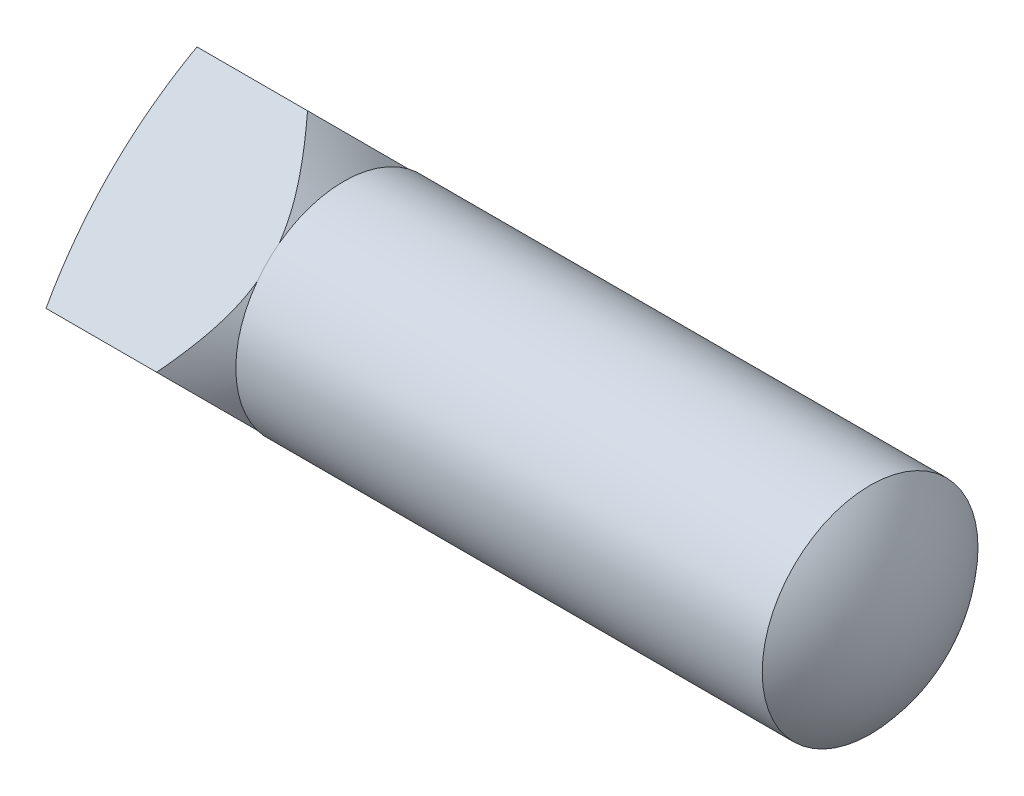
ISO-10303-21;
HEADER;
FILE_DESCRIPTION(('STEP AP214'),'2;1');
FILE_NAME('part.step','',(''),(''),'','','');
FILE_SCHEMA(('AUTOMOTIVE_DESIGN { 1 0 10303 214 1 1 1 1 }'));
ENDSEC;
DATA;
#1=APPLICATION_CONTEXT('core data for automotive mechanical design processes');
#2=APPLICATION_PROTOCOL_DEFINITION('international standard','automotive_design',2000,#1);
#3=PRODUCT_CONTEXT('',#1,'mechanical');
#4=PRODUCT('Part','Part','',(#3));
#5=PRODUCT_RELATED_PRODUCT_CATEGORY('part','',(#4));
#6=PRODUCT_DEFINITION_FORMATION('','',#4);
#7=PRODUCT_DEFINITION_CONTEXT('part definition',#1,'design');
#8=PRODUCT_DEFINITION('design','',#6,#7);
#9=PRODUCT_DEFINITION_SHAPE('','',#8);
#10=(LENGTH_UNIT() NAMED_UNIT(*) SI_UNIT(.MILLI.,.METRE.));
#11=(NAMED_UNIT(*) PLANE_ANGLE_UNIT() SI_UNIT($,.RADIAN.));
#12=(NAMED_UNIT(*) SI_UNIT($,.STERADIAN.) SOLID_ANGLE_UNIT());
#13=UNCERTAINTY_MEASURE_WITH_UNIT(LENGTH_MEASURE(1.E-05),#10,'distance_accuracy_value','');
#14=(GEOMETRIC_REPRESENTATION_CONTEXT(3) GLOBAL_UNCERTAINTY_ASSIGNED_CONTEXT((#13)) GLOBAL_UNIT_ASSIGNED_CONTEXT((#10,
#11,#12)) REPRESENTATION_CONTEXT('',''));
#15=CARTESIAN_POINT('',(0.,0.,0.));
#16=DIRECTION('',(0.,0.,1.));
#17=DIRECTION('',(1.,0.,0.));
#18=AXIS2_PLACEMENT_3D('',#15,#16,#17);
#19=CARTESIAN_POINT('',(-3.7592,0.,-3.376576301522));
#20=DIRECTION('',(0.,-0.707106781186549,0.707106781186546));
#21=DIRECTION('',(0.,-0.707106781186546,-0.707106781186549));
#22=AXIS2_PLACEMENT_3D('',#19,#20,#21);
#23=PLANE('',#22);
#24=CARTESIAN_POINT('',(-3.71463670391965,-2.84404188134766,-6.22061818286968));
#25=CARTESIAN_POINT('',(-3.55613835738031,-2.70146848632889,-6.07804478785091));
#26=CARTESIAN_POINT('',(-3.3981461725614,-2.55860959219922,-5.93518589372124));
#27=CARTESIAN_POINT('',(-3.08363247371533,-2.27203984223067,-5.64861614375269));
#28=CARTESIAN_POINT('',(-2.92711125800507,-2.12832882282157,-5.50490512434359));
#29=CARTESIAN_POINT('',(-2.61537743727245,-1.83919610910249,-5.2157724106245));
#30=CARTESIAN_POINT('',(-2.46017361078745,-1.69376967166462,-5.07034597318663));
#31=CARTESIAN_POINT('',(-2.15261018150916,-1.40143979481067,-4.77801609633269));
#32=CARTESIAN_POINT('',(-2.00025026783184,-1.25453651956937,-4.63111282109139));
#33=CARTESIAN_POINT('',(-1.72970912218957,-0.988182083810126,-4.36475838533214));
#34=CARTESIAN_POINT('',(-1.6107818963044,-0.869111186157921,-4.24568748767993));
#35=CARTESIAN_POINT('',(-1.37665028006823,-0.629105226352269,-4.00568152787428));
#36=CARTESIAN_POINT('',(-1.2614467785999,-0.508169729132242,-3.88474603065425));
#37=CARTESIAN_POINT('',(-1.03648369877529,-0.263755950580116,-3.64033225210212));
#38=CARTESIAN_POINT('',(-0.926724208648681,-0.140277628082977,-3.51685392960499));
#39=CARTESIAN_POINT('',(-0.768411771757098,0.0475823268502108,-3.3289939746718));
#40=CARTESIAN_POINT('',(-0.716703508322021,0.110632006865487,-3.26594429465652));
#41=CARTESIAN_POINT('',(-0.615958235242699,0.237786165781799,-3.13879013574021));
#42=CARTESIAN_POINT('',(-0.566920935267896,0.301890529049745,-3.07468577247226));
#43=CARTESIAN_POINT('',(-0.470564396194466,0.433616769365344,-2.94295953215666));
#44=CARTESIAN_POINT('',(-0.423365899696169,0.501283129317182,-2.87529317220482));
#45=CARTESIAN_POINT('',(-0.33366468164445,0.638144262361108,-2.7384320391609));
#46=CARTESIAN_POINT('',(-0.29116048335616,0.707338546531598,-2.66923775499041));
#47=CARTESIAN_POINT('',(-0.21229503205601,0.847303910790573,-2.52927239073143));
#48=CARTESIAN_POINT('',(-0.175920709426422,0.918071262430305,-2.4585050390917));
#49=CARTESIAN_POINT('',(-0.110910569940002,1.06137320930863,-2.31520309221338));
#50=CARTESIAN_POINT('',(-0.0822720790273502,1.13390718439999,-2.24266911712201));
#51=CARTESIAN_POINT('',(-0.0393755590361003,1.26582470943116,-2.11075159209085));
#52=CARTESIAN_POINT('',(-0.0233846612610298,1.3249242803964,-2.05165202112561));
#53=CARTESIAN_POINT('',(0.00161538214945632,1.44386018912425,-1.93271611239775));
#54=CARTESIAN_POINT('',(0.0106258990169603,1.50369637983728,-1.87287992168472));
#55=CARTESIAN_POINT('',(0.021092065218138,1.62355655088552,-1.75301975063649));
#56=CARTESIAN_POINT('',(0.0225662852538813,1.68357970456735,-1.69299659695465));
#57=CARTESIAN_POINT('',(0.0179155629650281,1.80348109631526,-1.57309520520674));
#58=CARTESIAN_POINT('',(0.0117896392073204,1.8633593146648,-1.5132169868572));
#59=CARTESIAN_POINT('',(-0.0100815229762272,1.99721927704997,-1.37935702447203));
#60=CARTESIAN_POINT('',(-0.02782647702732,2.0710373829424,-1.3055389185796));
#61=CARTESIAN_POINT('',(-0.0730208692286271,2.21718932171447,-1.15938697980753));
#62=CARTESIAN_POINT('',(-0.100477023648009,2.28952209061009,-1.08705421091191));
#63=CARTESIAN_POINT('',(-0.147658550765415,2.39694211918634,-0.979634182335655));
#64=CARTESIAN_POINT('',(-0.164455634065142,2.43269379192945,-0.943882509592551));
#65=CARTESIAN_POINT('',(-0.199813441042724,2.50374093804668,-0.872835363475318));
#66=CARTESIAN_POINT('',(-0.218373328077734,2.5390366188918,-0.837539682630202));
#67=CARTESIAN_POINT('',(-0.257053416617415,2.60919264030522,-0.767383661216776));
#68=CARTESIAN_POINT('',(-0.277173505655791,2.64405301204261,-0.732523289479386));
#69=CARTESIAN_POINT('',(-0.318791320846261,2.71336326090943,-0.663213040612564));
#70=CARTESIAN_POINT('',(-0.340289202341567,2.74781309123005,-0.628763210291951));
#71=CARTESIAN_POINT('',(-0.40321540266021,2.84534321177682,-0.531233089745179));
#72=CARTESIAN_POINT('',(-0.446099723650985,2.90795472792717,-0.468621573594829));
#73=CARTESIAN_POINT('',(-0.535121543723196,3.03201522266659,-0.344561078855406));
#74=CARTESIAN_POINT('',(-0.58125974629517,3.09346394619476,-0.28311235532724));
#75=CARTESIAN_POINT('',(-0.723571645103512,3.27639274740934,-0.100183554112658));
#76=CARTESIAN_POINT('',(-0.82358874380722,3.39637526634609,0.019798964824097));
#77=CARTESIAN_POINT('',(-1.03047356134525,3.63375592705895,0.257179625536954));
#78=CARTESIAN_POINT('',(-1.13735948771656,3.75114599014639,0.374569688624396));
#79=CARTESIAN_POINT('',(-1.35557896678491,3.98376603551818,0.607189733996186));
#80=CARTESIAN_POINT('',(-1.46691077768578,4.09899683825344,0.722420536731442));
#81=CARTESIAN_POINT('',(-1.69305612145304,4.32823502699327,0.951658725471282));
#82=CARTESIAN_POINT('',(-1.80787896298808,4.44223779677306,1.06566149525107));
#83=CARTESIAN_POINT('',(-2.03983717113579,4.66907271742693,1.29249641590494));
#84=CARTESIAN_POINT('',(-2.15697273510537,4.78190476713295,1.40532846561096));
#85=CARTESIAN_POINT('',(-2.39279712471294,5.00650286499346,1.62992656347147));
#86=CARTESIAN_POINT('',(-2.51148349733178,5.11827020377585,1.74169390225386));
#87=CARTESIAN_POINT('',(-2.75017246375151,5.34109999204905,1.96452369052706));
#88=CARTESIAN_POINT('',(-2.87017506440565,5.4521624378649,2.07558613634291));
#89=CARTESIAN_POINT('',(-3.05068333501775,5.61808795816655,2.24151165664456));
#90=CARTESIAN_POINT('',(-3.11080136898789,5.67316227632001,2.29658597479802));
#91=CARTESIAN_POINT('',(-3.23127854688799,5.78319708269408,2.40662078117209));
#92=CARTESIAN_POINT('',(-3.2916377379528,5.83815754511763,2.46158124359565));
#93=CARTESIAN_POINT('',(-3.41233885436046,5.94776482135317,2.57118851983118));
#94=CARTESIAN_POINT('',(-3.47268003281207,6.00241204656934,2.62583574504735));
#95=CARTESIAN_POINT('',(-3.59353260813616,6.11159399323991,2.73501769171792));
#96=CARTESIAN_POINT('',(-3.65404396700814,6.1661287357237,2.78955243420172));
#97=CARTESIAN_POINT('',(-3.71463670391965,6.22061818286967,2.84404188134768));
#98=B_SPLINE_CURVE_WITH_KNOTS('',3,(#24,#25,#26,#27,#28,#29,#30,#31,#32,#33,#34,#35,#36,#37,#38,
#39,#40,#41,#42,#43,#44,#45,#46,#47,#48,#49,#50,#51,#52,#53,#54,#55,#56,#57,#58,#59,#60,#61,#62,
#63,#64,#65,#66,#67,#68,#69,#70,#71,#72,#73,#74,#75,#76,#77,#78,#79,#80,#81,#82,#83,#84,#85,#86,
#87,#88,#89,#90,#91,#92,#93,#94,#95,#96,#97),.UNSPECIFIED.,.F.,.F.,(4,2,2,2,2,2,2,2,2,2,2,2,2,2,
2,2,2,2,2,2,2,2,2,2,2,2,2,2,2,2,2,2,2,2,2,2,4),(0.,0.769411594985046,1.53897600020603,
2.31192373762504,3.08478647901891,3.70321119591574,4.32178246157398,4.94036374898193,
5.24955145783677,5.55870549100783,5.87871228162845,6.19861811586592,6.51783299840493,
6.8369373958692,7.09196626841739,7.3469450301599,7.60129517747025,7.85567817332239,
8.17279662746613,8.49013483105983,8.6499415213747,8.80967274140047,8.96939245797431,
9.12913021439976,9.42418817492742,9.7193101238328,10.3099299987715,10.9021857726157,
11.4942117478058,12.0879855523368,12.6818102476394,13.2747881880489,13.8677692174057,
14.1629380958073,14.4581678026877,14.7523159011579,15.0464028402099),.UNSPECIFIED.);
#99=CARTESIAN_POINT('',(-0.808536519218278,0.,-3.376576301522));
#100=VERTEX_POINT('',#99);
#101=CARTESIAN_POINT('',(0.,1.44137193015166,-1.93520437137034));
#102=VERTEX_POINT('',#101);
#103=EDGE_CURVE('E154',#100,#102,#98,.T.);
#104=ORIENTED_EDGE('',*,*,#103,.F.);
#105=DIRECTION('',(1.,0.,0.));
#106=VECTOR('',#105,1.);
#107=CARTESIAN_POINT('',(-3.7592,0.,-3.376576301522));
#108=LINE('',#107,#106);
#109=CARTESIAN_POINT('',(-3.2823012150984,0.,-3.376576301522));
#110=VERTEX_POINT('',#109);
#111=EDGE_CURVE('E106',#110,#100,#108,.T.);
#112=ORIENTED_EDGE('',*,*,#111,.F.);
#113=CARTESIAN_POINT('',(8.4328,1.688288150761,-1.688288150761));
#114=DIRECTION('',(0.,-0.707106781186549,0.707106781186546));
#115=DIRECTION('',(0.,-0.707106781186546,-0.707106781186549));
#116=AXIS2_PLACEMENT_3D('',#113,#114,#115);
#117=CIRCLE('',#116,11.9559286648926);
#118=CARTESIAN_POINT('',(-3.2823012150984,3.376576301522,0.));
#119=VERTEX_POINT('',#118);
#120=EDGE_CURVE('E142',#119,#110,#117,.T.);
#121=ORIENTED_EDGE('',*,*,#120,.F.);
#122=DIRECTION('',(1.,0.,0.));
#123=VECTOR('',#122,1.);
#124=CARTESIAN_POINT('',(-3.7592,3.376576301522,0.));
#125=LINE('',#124,#123);
#126=CARTESIAN_POINT('',(-0.808536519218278,3.376576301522,0.));
#127=VERTEX_POINT('',#126);
#128=EDGE_CURVE('E140',#119,#127,#125,.T.);
#129=ORIENTED_EDGE('',*,*,#128,.T.);
#130=CARTESIAN_POINT('',(0.,1.93520437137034,-1.44137193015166));
#131=VERTEX_POINT('',#130);
#132=EDGE_CURVE('E164',#131,#127,#98,.T.);
#133=ORIENTED_EDGE('',*,*,#132,.F.);
#134=DIRECTION('',(0.,-0.707106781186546,-0.707106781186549));
#135=VECTOR('',#134,1.);
#136=CARTESIAN_POINT('',(0.,0.,-3.376576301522));
#137=LINE('',#136,#135);
#138=EDGE_CURVE('E41',#131,#102,#137,.T.);
#139=ORIENTED_EDGE('',*,*,#138,.T.);
#140=EDGE_LOOP('',(#104,#112,#121,#129,#133,#139));
#141=FACE_BOUND('',#140,.T.);
#142=ADVANCED_FACE('F33',(#141),#23,.F.);
#143=CARTESIAN_POINT('',(-3.7592,0.,-3.376576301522));
#144=DIRECTION('',(0.,0.707106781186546,0.707106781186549));
#145=DIRECTION('',(0.,-0.707106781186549,0.707106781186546));
#146=AXIS2_PLACEMENT_3D('',#143,#144,#145);
#147=PLANE('',#146);
#148=CARTESIAN_POINT('',(-3.71463670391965,-6.22061818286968,2.84404188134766));
#149=CARTESIAN_POINT('',(-3.55613835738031,-6.07804478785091,2.70146848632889));
#150=CARTESIAN_POINT('',(-3.3981461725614,-5.93518589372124,2.55860959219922));
#151=CARTESIAN_POINT('',(-3.08363247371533,-5.64861614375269,2.27203984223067));
#152=CARTESIAN_POINT('',(-2.92711125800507,-5.50490512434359,2.12832882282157));
#153=CARTESIAN_POINT('',(-2.61537743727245,-5.2157724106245,1.83919610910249));
#154=CARTESIAN_POINT('',(-2.46017361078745,-5.07034597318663,1.69376967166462));
#155=CARTESIAN_POINT('',(-2.15261018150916,-4.77801609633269,1.40143979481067));
#156=CARTESIAN_POINT('',(-2.00025026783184,-4.63111282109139,1.25453651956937));
#157=CARTESIAN_POINT('',(-1.72970912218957,-4.36475838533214,0.988182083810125));
#158=CARTESIAN_POINT('',(-1.6107818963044,-4.24568748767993,0.86911118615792));
#159=CARTESIAN_POINT('',(-1.37665028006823,-4.00568152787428,0.629105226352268));
#160=CARTESIAN_POINT('',(-1.2614467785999,-3.88474603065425,0.508169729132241));
#161=CARTESIAN_POINT('',(-1.03648369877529,-3.64033225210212,0.263755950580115));
#162=CARTESIAN_POINT('',(-0.92672420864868,-3.51685392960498,0.140277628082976));
#163=CARTESIAN_POINT('',(-0.768411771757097,-3.3289939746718,-0.0475823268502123));
#164=CARTESIAN_POINT('',(-0.716703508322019,-3.26594429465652,-0.110632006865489));
#165=CARTESIAN_POINT('',(-0.615958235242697,-3.13879013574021,-0.237786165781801));
#166=CARTESIAN_POINT('',(-0.566920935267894,-3.07468577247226,-0.301890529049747));
#167=CARTESIAN_POINT('',(-0.470564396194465,-2.94295953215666,-0.433616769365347));
#168=CARTESIAN_POINT('',(-0.423365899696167,-2.87529317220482,-0.501283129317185));
#169=CARTESIAN_POINT('',(-0.333664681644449,-2.7384320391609,-0.63814426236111));
#170=CARTESIAN_POINT('',(-0.291160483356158,-2.6692377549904,-0.707338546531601));
#171=CARTESIAN_POINT('',(-0.212295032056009,-2.52927239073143,-0.847303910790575));
#172=CARTESIAN_POINT('',(-0.175920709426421,-2.4585050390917,-0.918071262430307));
#173=CARTESIAN_POINT('',(-0.110910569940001,-2.31520309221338,-1.06137320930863));
#174=CARTESIAN_POINT('',(-0.08227207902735,-2.24266911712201,-1.13390718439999));
#175=CARTESIAN_POINT('',(-0.0393755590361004,-2.11075159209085,-1.26582470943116));
#176=CARTESIAN_POINT('',(-0.0233846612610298,-2.0516520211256,-1.3249242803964));
#177=CARTESIAN_POINT('',(0.00161538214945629,-1.93271611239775,-1.44386018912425));
#178=CARTESIAN_POINT('',(0.0106258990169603,-1.87287992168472,-1.50369637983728));
#179=CARTESIAN_POINT('',(0.0210920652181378,-1.75301975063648,-1.62355655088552));
#180=CARTESIAN_POINT('',(0.0225662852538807,-1.69299659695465,-1.68357970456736));
#181=CARTESIAN_POINT('',(0.0179155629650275,-1.57309520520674,-1.80348109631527));
#182=CARTESIAN_POINT('',(0.01178963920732,-1.5132169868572,-1.8633593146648));
#183=CARTESIAN_POINT('',(-0.0100815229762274,-1.37935702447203,-1.99721927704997));
#184=CARTESIAN_POINT('',(-0.0278264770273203,-1.3055389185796,-2.0710373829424));
#185=CARTESIAN_POINT('',(-0.0730208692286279,-1.15938697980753,-2.21718932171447));
#186=CARTESIAN_POINT('',(-0.10047702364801,-1.08705421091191,-2.28952209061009));
#187=CARTESIAN_POINT('',(-0.147658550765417,-0.979634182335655,-2.39694211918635));
#188=CARTESIAN_POINT('',(-0.164455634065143,-0.94388250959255,-2.43269379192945));
#189=CARTESIAN_POINT('',(-0.199813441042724,-0.872835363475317,-2.50374093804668));
#190=CARTESIAN_POINT('',(-0.218373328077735,-0.837539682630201,-2.5390366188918));
#191=CARTESIAN_POINT('',(-0.257053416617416,-0.767383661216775,-2.60919264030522));
#192=CARTESIAN_POINT('',(-0.277173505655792,-0.732523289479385,-2.64405301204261));
#193=CARTESIAN_POINT('',(-0.318791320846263,-0.663213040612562,-2.71336326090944));
#194=CARTESIAN_POINT('',(-0.340289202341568,-0.628763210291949,-2.74781309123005));
#195=CARTESIAN_POINT('',(-0.403215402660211,-0.531233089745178,-2.84534321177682));
#196=CARTESIAN_POINT('',(-0.446099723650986,-0.468621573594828,-2.90795472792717));
#197=CARTESIAN_POINT('',(-0.535121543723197,-0.344561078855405,-3.03201522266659));
#198=CARTESIAN_POINT('',(-0.581259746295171,-0.283112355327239,-3.09346394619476));
#199=CARTESIAN_POINT('',(-0.723571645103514,-0.100183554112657,-3.27639274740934));
#200=CARTESIAN_POINT('',(-0.823588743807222,0.0197989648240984,-3.39637526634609));
#201=CARTESIAN_POINT('',(-1.03047356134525,0.257179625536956,-3.63375592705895));
#202=CARTESIAN_POINT('',(-1.13735948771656,0.374569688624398,-3.75114599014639));
#203=CARTESIAN_POINT('',(-1.35557896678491,0.607189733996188,-3.98376603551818));
#204=CARTESIAN_POINT('',(-1.46691077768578,0.722420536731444,-4.09899683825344));
#205=CARTESIAN_POINT('',(-1.69305612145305,0.951658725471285,-4.32823502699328));
#206=CARTESIAN_POINT('',(-1.80787896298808,1.06566149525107,-4.44223779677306));
#207=CARTESIAN_POINT('',(-2.03983717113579,1.29249641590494,-4.66907271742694));
#208=CARTESIAN_POINT('',(-2.15697273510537,1.40532846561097,-4.78190476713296));
#209=CARTESIAN_POINT('',(-2.39279712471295,1.62992656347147,-5.00650286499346));
#210=CARTESIAN_POINT('',(-2.51148349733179,1.74169390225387,-5.11827020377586));
#211=CARTESIAN_POINT('',(-2.75017246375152,1.96452369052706,-5.34109999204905));
#212=CARTESIAN_POINT('',(-2.87017506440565,2.07558613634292,-5.4521624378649));
#213=CARTESIAN_POINT('',(-3.05068333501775,2.24151165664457,-5.61808795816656));
#214=CARTESIAN_POINT('',(-3.11080136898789,2.29658597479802,-5.67316227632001));
#215=CARTESIAN_POINT('',(-3.231278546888,2.40662078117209,-5.78319708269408));
#216=CARTESIAN_POINT('',(-3.29163773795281,2.46158124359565,-5.83815754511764));
#217=CARTESIAN_POINT('',(-3.41233885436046,2.57118851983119,-5.94776482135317));
#218=CARTESIAN_POINT('',(-3.47268003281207,2.62583574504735,-6.00241204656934));
#219=CARTESIAN_POINT('',(-3.59353260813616,2.73501769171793,-6.11159399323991));
#220=CARTESIAN_POINT('',(-3.65404396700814,2.78955243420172,-6.1661287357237));
#221=CARTESIAN_POINT('',(-3.71463670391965,2.84404188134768,-6.22061818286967));
#222=B_SPLINE_CURVE_WITH_KNOTS('',3,(#148,#149,#150,#151,#152,#153,#154,#155,#156,#157,#158,
#159,#160,#161,#162,#163,#164,#165,#166,#167,#168,#169,#170,#171,#172,#173,#174,#175,#176,#177,
#178,#179,#180,#181,#182,#183,#184,#185,#186,#187,#188,#189,#190,#191,#192,#193,#194,#195,#196,
#197,#198,#199,#200,#201,#202,#203,#204,#205,#206,#207,#208,#209,#210,#211,#212,#213,#214,#215,
#216,#217,#218,#219,#220,#221),.UNSPECIFIED.,.F.,.F.,(4,2,2,2,2,2,2,2,2,2,2,2,2,2,2,2,2,2,2,2,2,
2,2,2,2,2,2,2,2,2,2,2,2,2,2,2,4),(0.,0.769411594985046,1.53897600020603,2.31192373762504,
3.0847864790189,3.70321119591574,4.32178246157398,4.94036374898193,5.24955145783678,
5.55870549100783,5.87871228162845,6.19861811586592,6.51783299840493,6.8369373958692,
7.09196626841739,7.3469450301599,7.60129517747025,7.85567817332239,8.17279662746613,
8.49013483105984,8.6499415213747,8.80967274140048,8.96939245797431,9.12913021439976,
9.42418817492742,9.7193101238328,10.3099299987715,10.9021857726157,11.4942117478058,
12.0879855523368,12.6818102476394,13.2747881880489,13.8677692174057,14.1629380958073,
14.4581678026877,14.7523159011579,15.0464028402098),.UNSPECIFIED.);
#223=CARTESIAN_POINT('',(-0.808536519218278,-3.376576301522,0.));
#224=VERTEX_POINT('',#223);
#225=CARTESIAN_POINT('',(0.,-1.93520437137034,-1.44137193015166));
#226=VERTEX_POINT('',#225);
#227=EDGE_CURVE('E155',#224,#226,#222,.T.);
#228=ORIENTED_EDGE('',*,*,#227,.F.);
#229=DIRECTION('',(1.,0.,0.));
#230=VECTOR('',#229,1.);
#231=CARTESIAN_POINT('',(-3.7592,-3.376576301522,0.));
#232=LINE('',#231,#230);
#233=CARTESIAN_POINT('',(-3.2823012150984,-3.376576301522,0.));
#234=VERTEX_POINT('',#233);
#235=EDGE_CURVE('E136',#234,#224,#232,.T.);
#236=ORIENTED_EDGE('',*,*,#235,.F.);
#237=CARTESIAN_POINT('',(8.4328,-1.688288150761,-1.688288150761));
#238=DIRECTION('',(0.,0.707106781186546,0.707106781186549));
#239=DIRECTION('',(0.,-0.707106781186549,0.707106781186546));
#240=AXIS2_PLACEMENT_3D('',#237,#238,#239);
#241=CIRCLE('',#240,11.9559286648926);
#242=EDGE_CURVE('E151',#110,#234,#241,.T.);
#243=ORIENTED_EDGE('',*,*,#242,.F.);
#244=ORIENTED_EDGE('',*,*,#111,.T.);
#245=CARTESIAN_POINT('',(0.,-1.44137193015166,-1.93520437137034));
#246=VERTEX_POINT('',#245);
#247=EDGE_CURVE('E162',#246,#100,#222,.T.);
#248=ORIENTED_EDGE('',*,*,#247,.F.);
#249=DIRECTION('',(0.,-0.707106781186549,0.707106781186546));
#250=VECTOR('',#249,1.);
#251=CARTESIAN_POINT('',(0.,0.,-3.376576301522));
#252=LINE('',#251,#250);
#253=EDGE_CURVE('E131',#246,#226,#252,.T.);
#254=ORIENTED_EDGE('',*,*,#253,.T.);
#255=EDGE_LOOP('',(#228,#236,#243,#244,#248,#254));
#256=FACE_BOUND('',#255,.T.);
#257=ADVANCED_FACE('F170',(#256),#147,.F.);
#258=CARTESIAN_POINT('',(-3.7592,-3.376576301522,0.));
#259=DIRECTION('',(0.,0.707106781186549,-0.707106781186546));
#260=DIRECTION('',(0.,0.707106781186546,0.707106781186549));
#261=AXIS2_PLACEMENT_3D('',#258,#259,#260);
#262=PLANE('',#261);
#263=CARTESIAN_POINT('',(-3.71463670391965,2.84404188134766,6.22061818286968));
#264=CARTESIAN_POINT('',(-3.55613835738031,2.70146848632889,6.07804478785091));
#265=CARTESIAN_POINT('',(-3.3981461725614,2.55860959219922,5.93518589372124));
#266=CARTESIAN_POINT('',(-3.08363247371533,2.27203984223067,5.64861614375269));
#267=CARTESIAN_POINT('',(-2.92711125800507,2.12832882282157,5.50490512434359));
#268=CARTESIAN_POINT('',(-2.61537743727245,1.83919610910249,5.2157724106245));
#269=CARTESIAN_POINT('',(-2.46017361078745,1.69376967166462,5.07034597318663));
#270=CARTESIAN_POINT('',(-2.15261018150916,1.40143979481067,4.77801609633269));
#271=CARTESIAN_POINT('',(-2.00025026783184,1.25453651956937,4.63111282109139));
#272=CARTESIAN_POINT('',(-1.72970912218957,0.988182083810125,4.36475838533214));
#273=CARTESIAN_POINT('',(-1.6107818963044,0.86911118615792,4.24568748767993));
#274=CARTESIAN_POINT('',(-1.37665028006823,0.629105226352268,4.00568152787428));
#275=CARTESIAN_POINT('',(-1.2614467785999,0.508169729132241,3.88474603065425));
#276=CARTESIAN_POINT('',(-1.03648369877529,0.263755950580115,3.64033225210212));
#277=CARTESIAN_POINT('',(-0.92672420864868,0.140277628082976,3.51685392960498));
#278=CARTESIAN_POINT('',(-0.768411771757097,-0.0475823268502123,3.3289939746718));
#279=CARTESIAN_POINT('',(-0.716703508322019,-0.110632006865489,3.26594429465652));
#280=CARTESIAN_POINT('',(-0.615958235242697,-0.237786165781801,3.13879013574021));
#281=CARTESIAN_POINT('',(-0.566920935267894,-0.301890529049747,3.07468577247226));
#282=CARTESIAN_POINT('',(-0.470564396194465,-0.433616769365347,2.94295953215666));
#283=CARTESIAN_POINT('',(-0.423365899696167,-0.501283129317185,2.87529317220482));
#284=CARTESIAN_POINT('',(-0.333664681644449,-0.63814426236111,2.7384320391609));
#285=CARTESIAN_POINT('',(-0.291160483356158,-0.707338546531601,2.6692377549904));
#286=CARTESIAN_POINT('',(-0.212295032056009,-0.847303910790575,2.52927239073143));
#287=CARTESIAN_POINT('',(-0.175920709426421,-0.918071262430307,2.4585050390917));
#288=CARTESIAN_POINT('',(-0.110910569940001,-1.06137320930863,2.31520309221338));
#289=CARTESIAN_POINT('',(-0.08227207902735,-1.13390718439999,2.24266911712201));
#290=CARTESIAN_POINT('',(-0.0393755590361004,-1.26582470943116,2.11075159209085));
#291=CARTESIAN_POINT('',(-0.0233846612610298,-1.3249242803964,2.0516520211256));
#292=CARTESIAN_POINT('',(0.00161538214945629,-1.44386018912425,1.93271611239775));
#293=CARTESIAN_POINT('',(0.0106258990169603,-1.50369637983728,1.87287992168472));
#294=CARTESIAN_POINT('',(0.0210920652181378,-1.62355655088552,1.75301975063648));
#295=CARTESIAN_POINT('',(0.0225662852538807,-1.68357970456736,1.69299659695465));
#296=CARTESIAN_POINT('',(0.0179155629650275,-1.80348109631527,1.57309520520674));
#297=CARTESIAN_POINT('',(0.01178963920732,-1.8633593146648,1.5132169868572));
#298=CARTESIAN_POINT('',(-0.0100815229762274,-1.99721927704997,1.37935702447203));
#299=CARTESIAN_POINT('',(-0.0278264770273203,-2.0710373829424,1.3055389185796));
#300=CARTESIAN_POINT('',(-0.0730208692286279,-2.21718932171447,1.15938697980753));
#301=CARTESIAN_POINT('',(-0.10047702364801,-2.28952209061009,1.08705421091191));
#302=CARTESIAN_POINT('',(-0.147658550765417,-2.39694211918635,0.979634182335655));
#303=CARTESIAN_POINT('',(-0.164455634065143,-2.43269379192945,0.94388250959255));
#304=CARTESIAN_POINT('',(-0.199813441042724,-2.50374093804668,0.872835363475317));
#305=CARTESIAN_POINT('',(-0.218373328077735,-2.5390366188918,0.837539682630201));
#306=CARTESIAN_POINT('',(-0.257053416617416,-2.60919264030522,0.767383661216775));
#307=CARTESIAN_POINT('',(-0.277173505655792,-2.64405301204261,0.732523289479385));
#308=CARTESIAN_POINT('',(-0.318791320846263,-2.71336326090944,0.663213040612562));
#309=CARTESIAN_POINT('',(-0.340289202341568,-2.74781309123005,0.628763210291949));
#310=CARTESIAN_POINT('',(-0.403215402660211,-2.84534321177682,0.531233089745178));
#311=CARTESIAN_POINT('',(-0.446099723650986,-2.90795472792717,0.468621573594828));
#312=CARTESIAN_POINT('',(-0.535121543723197,-3.03201522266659,0.344561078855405));
#313=CARTESIAN_POINT('',(-0.581259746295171,-3.09346394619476,0.283112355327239));
#314=CARTESIAN_POINT('',(-0.723571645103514,-3.27639274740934,0.100183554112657));
#315=CARTESIAN_POINT('',(-0.823588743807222,-3.39637526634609,-0.0197989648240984));
#316=CARTESIAN_POINT('',(-1.03047356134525,-3.63375592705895,-0.257179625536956));
#317=CARTESIAN_POINT('',(-1.13735948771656,-3.75114599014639,-0.374569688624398));
#318=CARTESIAN_POINT('',(-1.35557896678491,-3.98376603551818,-0.607189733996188));
#319=CARTESIAN_POINT('',(-1.46691077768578,-4.09899683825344,-0.722420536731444));
#320=CARTESIAN_POINT('',(-1.69305612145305,-4.32823502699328,-0.951658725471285));
#321=CARTESIAN_POINT('',(-1.80787896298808,-4.44223779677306,-1.06566149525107));
#322=CARTESIAN_POINT('',(-2.03983717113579,-4.66907271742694,-1.29249641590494));
#323=CARTESIAN_POINT('',(-2.15697273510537,-4.78190476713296,-1.40532846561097));
#324=CARTESIAN_POINT('',(-2.39279712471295,-5.00650286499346,-1.62992656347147));
#325=CARTESIAN_POINT('',(-2.51148349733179,-5.11827020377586,-1.74169390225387));
#326=CARTESIAN_POINT('',(-2.75017246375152,-5.34109999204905,-1.96452369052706));
#327=CARTESIAN_POINT('',(-2.87017506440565,-5.4521624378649,-2.07558613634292));
#328=CARTESIAN_POINT('',(-3.05068333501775,-5.61808795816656,-2.24151165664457));
#329=CARTESIAN_POINT('',(-3.11080136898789,-5.67316227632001,-2.29658597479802));
#330=CARTESIAN_POINT('',(-3.231278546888,-5.78319708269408,-2.40662078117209));
#331=CARTESIAN_POINT('',(-3.29163773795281,-5.83815754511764,-2.46158124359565));
#332=CARTESIAN_POINT('',(-3.41233885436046,-5.94776482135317,-2.57118851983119));
#333=CARTESIAN_POINT('',(-3.47268003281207,-6.00241204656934,-2.62583574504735));
#334=CARTESIAN_POINT('',(-3.59353260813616,-6.11159399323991,-2.73501769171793));
#335=CARTESIAN_POINT('',(-3.65404396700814,-6.1661287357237,-2.78955243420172));
#336=CARTESIAN_POINT('',(-3.71463670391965,-6.22061818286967,-2.84404188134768));
#337=B_SPLINE_CURVE_WITH_KNOTS('',3,(#263,#264,#265,#266,#267,#268,#269,#270,#271,#272,#273,
#274,#275,#276,#277,#278,#279,#280,#281,#282,#283,#284,#285,#286,#287,#288,#289,#290,#291,#292,
#293,#294,#295,#296,#297,#298,#299,#300,#301,#302,#303,#304,#305,#306,#307,#308,#309,#310,#311,
#312,#313,#314,#315,#316,#317,#318,#319,#320,#321,#322,#323,#324,#325,#326,#327,#328,#329,#330,
#331,#332,#333,#334,#335,#336),.UNSPECIFIED.,.F.,.F.,(4,2,2,2,2,2,2,2,2,2,2,2,2,2,2,2,2,2,2,2,2,
2,2,2,2,2,2,2,2,2,2,2,2,2,2,2,4),(0.,0.769411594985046,1.53897600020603,2.31192373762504,
3.0847864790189,3.70321119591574,4.32178246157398,4.94036374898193,5.24955145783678,
5.55870549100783,5.87871228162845,6.19861811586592,6.51783299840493,6.8369373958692,
7.09196626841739,7.3469450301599,7.60129517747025,7.85567817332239,8.17279662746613,
8.49013483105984,8.6499415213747,8.80967274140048,8.96939245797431,9.12913021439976,
9.42418817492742,9.7193101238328,10.3099299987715,10.9021857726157,11.4942117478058,
12.0879855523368,12.6818102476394,13.2747881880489,13.8677692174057,14.1629380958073,
14.4581678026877,14.7523159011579,15.0464028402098),.UNSPECIFIED.);
#338=CARTESIAN_POINT('',(-0.808536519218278,0.,3.376576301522));
#339=VERTEX_POINT('',#338);
#340=CARTESIAN_POINT('',(0.,-1.44137193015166,1.93520437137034));
#341=VERTEX_POINT('',#340);
#342=EDGE_CURVE('E55',#339,#341,#337,.T.);
#343=ORIENTED_EDGE('',*,*,#342,.F.);
#344=DIRECTION('',(1.,0.,0.));
#345=VECTOR('',#344,1.);
#346=CARTESIAN_POINT('',(-3.7592,0.,3.376576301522));
#347=LINE('',#346,#345);
#348=CARTESIAN_POINT('',(-3.2823012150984,0.,3.376576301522));
#349=VERTEX_POINT('',#348);
#350=EDGE_CURVE('E117',#349,#339,#347,.T.);
#351=ORIENTED_EDGE('',*,*,#350,.F.);
#352=CARTESIAN_POINT('',(8.4328,-1.688288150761,1.688288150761));
#353=DIRECTION('',(0.,0.707106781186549,-0.707106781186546));
#354=DIRECTION('',(0.,0.707106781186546,0.707106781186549));
#355=AXIS2_PLACEMENT_3D('',#352,#353,#354);
#356=CIRCLE('',#355,11.9559286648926);
#357=EDGE_CURVE('E47',#234,#349,#356,.T.);
#358=ORIENTED_EDGE('',*,*,#357,.F.);
#359=ORIENTED_EDGE('',*,*,#235,.T.);
#360=CARTESIAN_POINT('',(0.,-1.93520437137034,1.44137193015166));
#361=VERTEX_POINT('',#360);
#362=EDGE_CURVE('E163',#361,#224,#337,.T.);
#363=ORIENTED_EDGE('',*,*,#362,.F.);
#364=DIRECTION('',(0.,0.707106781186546,0.707106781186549));
#365=VECTOR('',#364,1.);
#366=CARTESIAN_POINT('',(0.,-3.376576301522,0.));
#367=LINE('',#366,#365);
#368=EDGE_CURVE('E123',#361,#341,#367,.T.);
#369=ORIENTED_EDGE('',*,*,#368,.T.);
#370=EDGE_LOOP('',(#343,#351,#358,#359,#363,#369));
#371=FACE_BOUND('',#370,.T.);
#372=ADVANCED_FACE('F191',(#371),#262,.F.);
#373=CARTESIAN_POINT('',(-3.7592,3.376576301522,0.));
#374=DIRECTION('',(0.,-0.707106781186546,-0.707106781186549));
#375=DIRECTION('',(0.,0.707106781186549,-0.707106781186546));
#376=AXIS2_PLACEMENT_3D('',#373,#374,#375);
#377=PLANE('',#376);
#378=CARTESIAN_POINT('',(-3.71463670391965,6.22061818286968,-2.84404188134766));
#379=CARTESIAN_POINT('',(-3.55613835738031,6.07804478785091,-2.70146848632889));
#380=CARTESIAN_POINT('',(-3.3981461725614,5.93518589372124,-2.55860959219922));
#381=CARTESIAN_POINT('',(-3.08363247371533,5.64861614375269,-2.27203984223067));
#382=CARTESIAN_POINT('',(-2.92711125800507,5.50490512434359,-2.12832882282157));
#383=CARTESIAN_POINT('',(-2.61537743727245,5.2157724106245,-1.83919610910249));
#384=CARTESIAN_POINT('',(-2.46017361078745,5.07034597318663,-1.69376967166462));
#385=CARTESIAN_POINT('',(-2.15261018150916,4.77801609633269,-1.40143979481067));
#386=CARTESIAN_POINT('',(-2.00025026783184,4.63111282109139,-1.25453651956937));
#387=CARTESIAN_POINT('',(-1.72970912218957,4.36475838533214,-0.988182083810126));
#388=CARTESIAN_POINT('',(-1.6107818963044,4.24568748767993,-0.869111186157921));
#389=CARTESIAN_POINT('',(-1.37665028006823,4.00568152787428,-0.629105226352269));
#390=CARTESIAN_POINT('',(-1.2614467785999,3.88474603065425,-0.508169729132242));
#391=CARTESIAN_POINT('',(-1.03648369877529,3.64033225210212,-0.263755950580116));
#392=CARTESIAN_POINT('',(-0.926724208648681,3.51685392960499,-0.140277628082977));
#393=CARTESIAN_POINT('',(-0.768411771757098,3.3289939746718,0.0475823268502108));
#394=CARTESIAN_POINT('',(-0.716703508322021,3.26594429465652,0.110632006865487));
#395=CARTESIAN_POINT('',(-0.615958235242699,3.13879013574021,0.237786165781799));
#396=CARTESIAN_POINT('',(-0.566920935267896,3.07468577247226,0.301890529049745));
#397=CARTESIAN_POINT('',(-0.470564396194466,2.94295953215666,0.433616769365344));
#398=CARTESIAN_POINT('',(-0.423365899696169,2.87529317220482,0.501283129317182));
#399=CARTESIAN_POINT('',(-0.33366468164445,2.7384320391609,0.638144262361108));
#400=CARTESIAN_POINT('',(-0.29116048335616,2.66923775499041,0.707338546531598));
#401=CARTESIAN_POINT('',(-0.21229503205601,2.52927239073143,0.847303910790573));
#402=CARTESIAN_POINT('',(-0.175920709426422,2.4585050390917,0.918071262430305));
#403=CARTESIAN_POINT('',(-0.110910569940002,2.31520309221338,1.06137320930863));
#404=CARTESIAN_POINT('',(-0.0822720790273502,2.24266911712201,1.13390718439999));
#405=CARTESIAN_POINT('',(-0.0393755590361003,2.11075159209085,1.26582470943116));
#406=CARTESIAN_POINT('',(-0.0233846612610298,2.05165202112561,1.3249242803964));
#407=CARTESIAN_POINT('',(0.00161538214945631,1.93271611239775,1.44386018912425));
#408=CARTESIAN_POINT('',(0.0106258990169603,1.87287992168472,1.50369637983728));
#409=CARTESIAN_POINT('',(0.021092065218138,1.75301975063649,1.62355655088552));
#410=CARTESIAN_POINT('',(0.0225662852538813,1.69299659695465,1.68357970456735));
#411=CARTESIAN_POINT('',(0.0179155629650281,1.57309520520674,1.80348109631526));
#412=CARTESIAN_POINT('',(0.0117896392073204,1.5132169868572,1.8633593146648));
#413=CARTESIAN_POINT('',(-0.0100815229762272,1.37935702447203,1.99721927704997));
#414=CARTESIAN_POINT('',(-0.0278264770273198,1.3055389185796,2.0710373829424));
#415=CARTESIAN_POINT('',(-0.073020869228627,1.15938697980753,2.21718932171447));
#416=CARTESIAN_POINT('',(-0.100477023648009,1.08705421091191,2.28952209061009));
#417=CARTESIAN_POINT('',(-0.147658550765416,0.979634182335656,2.39694211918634));
#418=CARTESIAN_POINT('',(-0.164455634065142,0.943882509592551,2.43269379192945));
#419=CARTESIAN_POINT('',(-0.199813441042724,0.872835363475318,2.50374093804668));
#420=CARTESIAN_POINT('',(-0.218373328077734,0.837539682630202,2.5390366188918));
#421=CARTESIAN_POINT('',(-0.257053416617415,0.767383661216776,2.60919264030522));
#422=CARTESIAN_POINT('',(-0.277173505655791,0.732523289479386,2.64405301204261));
#423=CARTESIAN_POINT('',(-0.318791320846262,0.663213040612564,2.71336326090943));
#424=CARTESIAN_POINT('',(-0.340289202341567,0.628763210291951,2.74781309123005));
#425=CARTESIAN_POINT('',(-0.40321540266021,0.531233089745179,2.84534321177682));
#426=CARTESIAN_POINT('',(-0.446099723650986,0.468621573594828,2.90795472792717));
#427=CARTESIAN_POINT('',(-0.535121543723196,0.344561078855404,3.03201522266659));
#428=CARTESIAN_POINT('',(-0.58125974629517,0.283112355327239,3.09346394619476));
#429=CARTESIAN_POINT('',(-0.723571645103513,0.100183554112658,3.27639274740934));
#430=CARTESIAN_POINT('',(-0.823588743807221,-0.0197989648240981,3.39637526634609));
#431=CARTESIAN_POINT('',(-1.03047356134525,-0.257179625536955,3.63375592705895));
#432=CARTESIAN_POINT('',(-1.13735948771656,-0.374569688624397,3.75114599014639));
#433=CARTESIAN_POINT('',(-1.35557896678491,-0.607189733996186,3.98376603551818));
#434=CARTESIAN_POINT('',(-1.46691077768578,-0.722420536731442,4.09899683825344));
#435=CARTESIAN_POINT('',(-1.69305612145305,-0.951658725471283,4.32823502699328));
#436=CARTESIAN_POINT('',(-1.80787896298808,-1.06566149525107,4.44223779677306));
#437=CARTESIAN_POINT('',(-2.03983717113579,-1.29249641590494,4.66907271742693));
#438=CARTESIAN_POINT('',(-2.15697273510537,-1.40532846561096,4.78190476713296));
#439=CARTESIAN_POINT('',(-2.39279712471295,-1.62992656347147,5.00650286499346));
#440=CARTESIAN_POINT('',(-2.51148349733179,-1.74169390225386,5.11827020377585));
#441=CARTESIAN_POINT('',(-2.75017246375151,-1.96452369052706,5.34109999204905));
#442=CARTESIAN_POINT('',(-2.87017506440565,-2.07558613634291,5.4521624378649));
#443=CARTESIAN_POINT('',(-3.05068333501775,-2.24151165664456,5.61808795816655));
#444=CARTESIAN_POINT('',(-3.11080136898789,-2.29658597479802,5.67316227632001));
#445=CARTESIAN_POINT('',(-3.231278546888,-2.40662078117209,5.78319708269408));
#446=CARTESIAN_POINT('',(-3.29163773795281,-2.46158124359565,5.83815754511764));
#447=CARTESIAN_POINT('',(-3.41233885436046,-2.57118851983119,5.94776482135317));
#448=CARTESIAN_POINT('',(-3.47268003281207,-2.62583574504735,6.00241204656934));
#449=CARTESIAN_POINT('',(-3.59353260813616,-2.73501769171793,6.11159399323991));
#450=CARTESIAN_POINT('',(-3.65404396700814,-2.78955243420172,6.1661287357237));
#451=CARTESIAN_POINT('',(-3.71463670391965,-2.84404188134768,6.22061818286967));
#452=B_SPLINE_CURVE_WITH_KNOTS('',3,(#378,#379,#380,#381,#382,#383,#384,#385,#386,#387,#388,
#389,#390,#391,#392,#393,#394,#395,#396,#397,#398,#399,#400,#401,#402,#403,#404,#405,#406,#407,
#408,#409,#410,#411,#412,#413,#414,#415,#416,#417,#418,#419,#420,#421,#422,#423,#424,#425,#426,
#427,#428,#429,#430,#431,#432,#433,#434,#435,#436,#437,#438,#439,#440,#441,#442,#443,#444,#445,
#446,#447,#448,#449,#450,#451),.UNSPECIFIED.,.F.,.F.,(4,2,2,2,2,2,2,2,2,2,2,2,2,2,2,2,2,2,2,2,2,
2,2,2,2,2,2,2,2,2,2,2,2,2,2,2,4),(0.,0.769411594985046,1.53897600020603,2.31192373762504,
3.08478647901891,3.70321119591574,4.32178246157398,4.94036374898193,5.24955145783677,
5.55870549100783,5.87871228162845,6.19861811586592,6.51783299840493,6.8369373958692,
7.09196626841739,7.3469450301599,7.60129517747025,7.85567817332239,8.17279662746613,
8.49013483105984,8.6499415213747,8.80967274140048,8.96939245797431,9.12913021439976,
9.42418817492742,9.7193101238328,10.3099299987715,10.9021857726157,11.4942117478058,
12.0879855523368,12.6818102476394,13.2747881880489,13.8677692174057,14.1629380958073,
14.4581678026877,14.7523159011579,15.0464028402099),.UNSPECIFIED.);
#453=CARTESIAN_POINT('',(0.,1.93520437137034,1.44137193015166));
#454=VERTEX_POINT('',#453);
#455=EDGE_CURVE('E119',#127,#454,#452,.T.);
#456=ORIENTED_EDGE('',*,*,#455,.F.);
#457=ORIENTED_EDGE('',*,*,#128,.F.);
#458=CARTESIAN_POINT('',(8.4328,1.688288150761,1.688288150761));
#459=DIRECTION('',(0.,-0.707106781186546,-0.707106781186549));
#460=DIRECTION('',(0.,0.707106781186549,-0.707106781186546));
#461=AXIS2_PLACEMENT_3D('',#458,#459,#460);
#462=CIRCLE('',#461,11.9559286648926);
#463=EDGE_CURVE('E11',#349,#119,#462,.T.);
#464=ORIENTED_EDGE('',*,*,#463,.F.);
#465=ORIENTED_EDGE('',*,*,#350,.T.);
#466=CARTESIAN_POINT('',(0.,1.44137193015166,1.93520437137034));
#467=VERTEX_POINT('',#466);
#468=EDGE_CURVE('E100',#467,#339,#452,.T.);
#469=ORIENTED_EDGE('',*,*,#468,.F.);
#470=DIRECTION('',(0.,0.707106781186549,-0.707106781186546));
#471=VECTOR('',#470,1.);
#472=CARTESIAN_POINT('',(0.,3.376576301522,0.));
#473=LINE('',#472,#471);
#474=EDGE_CURVE('E115',#467,#454,#473,.T.);
#475=ORIENTED_EDGE('',*,*,#474,.T.);
#476=EDGE_LOOP('',(#456,#457,#464,#465,#469,#475));
#477=FACE_BOUND('',#476,.T.);
#478=ADVANCED_FACE('F114',(#477),#377,.F.);
#479=CARTESIAN_POINT('',(0.,0.,0.));
#480=DIRECTION('',(-1.,0.,0.));
#481=DIRECTION('',(0.,0.,1.));
#482=AXIS2_PLACEMENT_3D('',#479,#480,#481);
#483=PLANE('',#482);
#484=ORIENTED_EDGE('',*,*,#138,.F.);
#485=CARTESIAN_POINT('',(0.,0.,0.));
#486=DIRECTION('',(-1.,0.,0.));
#487=DIRECTION('',(0.,0.,1.));
#488=AXIS2_PLACEMENT_3D('',#485,#486,#487);
#489=CIRCLE('',#488,2.413);
#490=EDGE_CURVE('E132',#131,#102,#489,.T.);
#491=ORIENTED_EDGE('',*,*,#490,.T.);
#492=EDGE_LOOP('',(#484,#491));
#493=FACE_BOUND('',#492,.T.);
#494=ADVANCED_FACE('F197',(#493),#483,.T.);
#495=ORIENTED_EDGE('',*,*,#474,.F.);
#496=EDGE_CURVE('E108',#467,#454,#489,.T.);
#497=ORIENTED_EDGE('',*,*,#496,.T.);
#498=EDGE_LOOP('',(#495,#497));
#499=FACE_BOUND('',#498,.T.);
#500=ADVANCED_FACE('F122',(#499),#483,.T.);
#501=ORIENTED_EDGE('',*,*,#368,.F.);
#502=EDGE_CURVE('E105',#361,#341,#489,.T.);
#503=ORIENTED_EDGE('',*,*,#502,.T.);
#504=EDGE_LOOP('',(#501,#503));
#505=FACE_BOUND('',#504,.T.);
#506=ADVANCED_FACE('F214',(#505),#483,.T.);
#507=CARTESIAN_POINT('',(9.0932,0.,0.));
#508=DIRECTION('',(-1.,0.,0.));
#509=DIRECTION('',(0.,1.,0.));
#510=AXIS2_PLACEMENT_3D('',#507,#508,#509);
#511=SPHERICAL_SURFACE('',#510,3.6068);
#512=CARTESIAN_POINT('',(11.7739531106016,0.,0.));
#513=DIRECTION('',(-1.,0.,0.));
#514=DIRECTION('',(0.,0.,1.));
#515=AXIS2_PLACEMENT_3D('',#512,#513,#514);
#516=CIRCLE('',#515,2.413);
#517=CARTESIAN_POINT('',(11.7739531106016,0.,2.413));
#518=VERTEX_POINT('',#517);
#519=EDGE_CURVE('E129',#518,#518,#516,.T.);
#520=ORIENTED_EDGE('',*,*,#519,.F.);
#521=EDGE_LOOP('',(#520));
#522=FACE_BOUND('',#521,.T.);
#523=ADVANCED_FACE('F35',(#522),#511,.T.);
#524=CARTESIAN_POINT('',(-12.7,0.,0.));
#525=DIRECTION('',(-1.,0.,0.));
#526=DIRECTION('',(0.,0.,1.));
#527=AXIS2_PLACEMENT_3D('',#524,#525,#526);
#528=CYLINDRICAL_SURFACE('',#527,2.413);
#529=ORIENTED_EDGE('',*,*,#519,.T.);
#530=EDGE_LOOP('',(#529));
#531=FACE_BOUND('',#530,.T.);
#532=ORIENTED_EDGE('',*,*,#496,.F.);
#533=EDGE_CURVE('E97',#341,#467,#489,.T.);
#534=ORIENTED_EDGE('',*,*,#533,.F.);
#535=ORIENTED_EDGE('',*,*,#502,.F.);
#536=EDGE_CURVE('E233',#226,#361,#489,.T.);
#537=ORIENTED_EDGE('',*,*,#536,.F.);
#538=EDGE_CURVE('E234',#246,#226,#489,.T.);
#539=ORIENTED_EDGE('',*,*,#538,.F.);
#540=EDGE_CURVE('E237',#102,#246,#489,.T.);
#541=ORIENTED_EDGE('',*,*,#540,.F.);
#542=ORIENTED_EDGE('',*,*,#490,.F.);
#543=EDGE_CURVE('E128',#454,#131,#489,.T.);
#544=ORIENTED_EDGE('',*,*,#543,.F.);
#545=EDGE_LOOP('',(#532,#534,#535,#537,#539,#541,#542,#544));
#546=FACE_BOUND('',#545,.T.);
#547=ADVANCED_FACE('F126',(#531,#546),#528,.T.);
#548=ORIENTED_EDGE('',*,*,#253,.F.);
#549=ORIENTED_EDGE('',*,*,#538,.T.);
#550=EDGE_LOOP('',(#548,#549));
#551=FACE_BOUND('',#550,.T.);
#552=ADVANCED_FACE('F203',(#551),#483,.T.);
#553=CARTESIAN_POINT('',(8.4328,0.,0.));
#554=DIRECTION('',(-1.,0.,0.));
#555=DIRECTION('',(0.,1.,0.));
#556=AXIS2_PLACEMENT_3D('',#553,#554,#555);
#557=SPHERICAL_SURFACE('',#556,12.192);
#558=CARTESIAN_POINT('',(-3.7592,0.,0.));
#559=VERTEX_POINT('',#558);
#560=VERTEX_LOOP('',#559);
#561=FACE_BOUND('',#560,.T.);
#562=ORIENTED_EDGE('',*,*,#120,.T.);
#563=ORIENTED_EDGE('',*,*,#242,.T.);
#564=ORIENTED_EDGE('',*,*,#357,.T.);
#565=ORIENTED_EDGE('',*,*,#463,.T.);
#566=EDGE_LOOP('',(#562,#563,#564,#565));
#567=FACE_BOUND('',#566,.T.);
#568=ADVANCED_FACE('F180',(#561,#567),#557,.T.);
#569=CARTESIAN_POINT('',(-0.808536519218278,0.,0.));
#570=DIRECTION('',(-1.,0.,0.));
#571=DIRECTION('',(0.,0.,1.));
#572=AXIS2_PLACEMENT_3D('',#569,#570,#571);
#573=CONICAL_SURFACE('',#572,3.376576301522,0.872664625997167);
#574=ORIENTED_EDGE('',*,*,#342,.T.);
#575=ORIENTED_EDGE('',*,*,#533,.T.);
#576=ORIENTED_EDGE('',*,*,#468,.T.);
#577=EDGE_LOOP('',(#574,#575,#576));
#578=FACE_BOUND('',#577,.T.);
#579=ADVANCED_FACE('F99',(#578),#573,.T.);
#580=ORIENTED_EDGE('',*,*,#227,.T.);
#581=ORIENTED_EDGE('',*,*,#536,.T.);
#582=ORIENTED_EDGE('',*,*,#362,.T.);
#583=EDGE_LOOP('',(#580,#581,#582));
#584=FACE_BOUND('',#583,.T.);
#585=ADVANCED_FACE('F178',(#584),#573,.T.);
#586=ORIENTED_EDGE('',*,*,#103,.T.);
#587=ORIENTED_EDGE('',*,*,#540,.T.);
#588=ORIENTED_EDGE('',*,*,#247,.T.);
#589=EDGE_LOOP('',(#586,#587,#588));
#590=FACE_BOUND('',#589,.T.);
#591=ADVANCED_FACE('F173',(#590),#573,.T.);
#592=ORIENTED_EDGE('',*,*,#132,.T.);
#593=ORIENTED_EDGE('',*,*,#455,.T.);
#594=ORIENTED_EDGE('',*,*,#543,.T.);
#595=EDGE_LOOP('',(#592,#593,#594));
#596=FACE_BOUND('',#595,.T.);
#597=ADVANCED_FACE('F177',(#596),#573,.T.);
#598=CLOSED_SHELL('',(#142,#257,#372,#478,#494,#500,#506,#523,#547,#552,#568,#579,#585,#591,#597));
#599=MANIFOLD_SOLID_BREP('B2',#598);
#600=ADVANCED_BREP_SHAPE_REPRESENTATION('',(#18,#599),#14);
#601=SHAPE_DEFINITION_REPRESENTATION(#9,#600);
ENDSEC;
END-ISO-10303-21;
